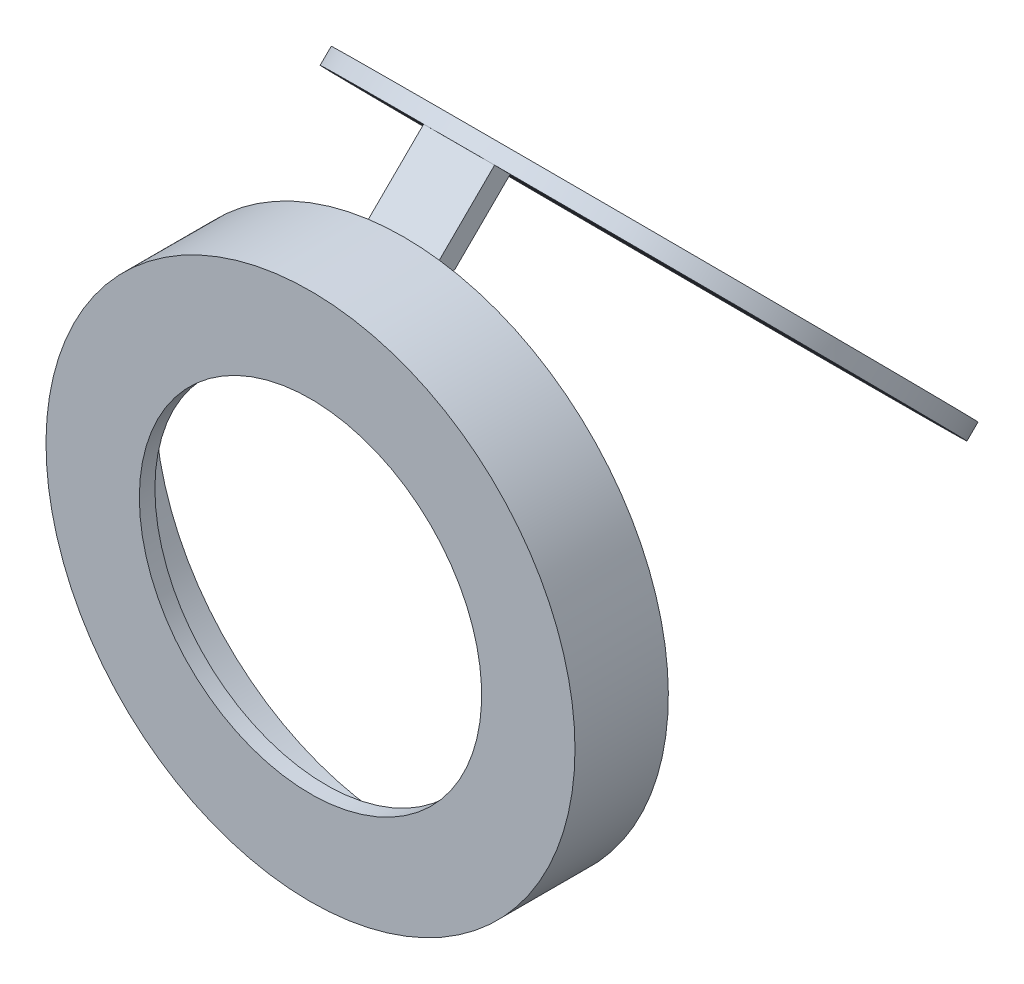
ISO-10303-21;
HEADER;
FILE_DESCRIPTION(('STEP AP214'),'2;1');
FILE_NAME('part.step','',(''),(''),'','','');
FILE_SCHEMA(('AUTOMOTIVE_DESIGN { 1 0 10303 214 1 1 1 1 }'));
ENDSEC;
DATA;
#1=APPLICATION_CONTEXT('core data for automotive mechanical design processes');
#2=APPLICATION_PROTOCOL_DEFINITION('international standard','automotive_design',2000,#1);
#3=PRODUCT_CONTEXT('',#1,'mechanical');
#4=PRODUCT('Part','Part','',(#3));
#5=PRODUCT_RELATED_PRODUCT_CATEGORY('part','',(#4));
#6=PRODUCT_DEFINITION_FORMATION('','',#4);
#7=PRODUCT_DEFINITION_CONTEXT('part definition',#1,'design');
#8=PRODUCT_DEFINITION('design','',#6,#7);
#9=PRODUCT_DEFINITION_SHAPE('','',#8);
#10=(LENGTH_UNIT() NAMED_UNIT(*) SI_UNIT(.MILLI.,.METRE.));
#11=(NAMED_UNIT(*) PLANE_ANGLE_UNIT() SI_UNIT($,.RADIAN.));
#12=(NAMED_UNIT(*) SI_UNIT($,.STERADIAN.) SOLID_ANGLE_UNIT());
#13=UNCERTAINTY_MEASURE_WITH_UNIT(LENGTH_MEASURE(1.E-05),#10,'distance_accuracy_value','');
#14=(GEOMETRIC_REPRESENTATION_CONTEXT(3) GLOBAL_UNCERTAINTY_ASSIGNED_CONTEXT((#13)) GLOBAL_UNIT_ASSIGNED_CONTEXT((#10,
#11,#12)) REPRESENTATION_CONTEXT('',''));
#15=CARTESIAN_POINT('',(0.,0.,0.));
#16=DIRECTION('',(0.,0.,1.));
#17=DIRECTION('',(1.,0.,0.));
#18=AXIS2_PLACEMENT_3D('',#15,#16,#17);
#19=CARTESIAN_POINT('',(0.,0.,-5.));
#20=DIRECTION('',(0.,0.,-1.));
#21=DIRECTION('',(-1.,0.,0.));
#22=AXIS2_PLACEMENT_3D('',#19,#20,#21);
#23=PLANE('',#22);
#24=DIRECTION('',(0.,1.,0.));
#25=VECTOR('',#24,1.);
#26=CARTESIAN_POINT('',(-2.27991716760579,16.8464232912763,-5.));
#27=LINE('',#26,#25);
#28=CARTESIAN_POINT('',(-2.27991716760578,15.8367287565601,-5.));
#29=VERTEX_POINT('',#28);
#30=CARTESIAN_POINT('',(-2.2799171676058,16.8464232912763,-5.));
#31=VERTEX_POINT('',#30);
#32=EDGE_CURVE('E55',#29,#31,#27,.T.);
#33=ORIENTED_EDGE('',*,*,#32,.F.);
#34=CARTESIAN_POINT('',(0.,0.,-5.));
#35=DIRECTION('',(0.,0.,-1.));
#36=DIRECTION('',(-1.,0.,0.));
#37=AXIS2_PLACEMENT_3D('',#34,#35,#36);
#38=CIRCLE('',#37,16.);
#39=CARTESIAN_POINT('',(2.27991716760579,15.8367287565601,-5.));
#40=VERTEX_POINT('',#39);
#41=EDGE_CURVE('E50',#40,#29,#38,.T.);
#42=ORIENTED_EDGE('',*,*,#41,.F.);
#43=DIRECTION('',(0.,-1.,0.));
#44=VECTOR('',#43,1.);
#45=CARTESIAN_POINT('',(2.27991716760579,16.8464232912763,-5.));
#46=LINE('',#45,#44);
#47=CARTESIAN_POINT('',(2.27991716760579,16.8464232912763,-5.));
#48=VERTEX_POINT('',#47);
#49=EDGE_CURVE('E130',#48,#40,#46,.T.);
#50=ORIENTED_EDGE('',*,*,#49,.F.);
#51=CARTESIAN_POINT('',(0.,0.,-5.));
#52=DIRECTION('',(0.,0.,-1.));
#53=DIRECTION('',(-1.,0.,0.));
#54=AXIS2_PLACEMENT_3D('',#51,#52,#53);
#55=CIRCLE('',#54,17.);
#56=EDGE_CURVE('E140',#48,#31,#55,.T.);
#57=ORIENTED_EDGE('',*,*,#56,.T.);
#58=EDGE_LOOP('',(#33,#42,#50,#57));
#59=FACE_BOUND('',#58,.T.);
#60=ADVANCED_FACE('F35',(#59),#23,.T.);
#61=CARTESIAN_POINT('',(0.,0.,0.));
#62=DIRECTION('',(0.,0.,1.));
#63=DIRECTION('',(1.,0.,0.));
#64=AXIS2_PLACEMENT_3D('',#61,#62,#63);
#65=PLANE('',#64);
#66=CARTESIAN_POINT('',(0.,0.,0.));
#67=DIRECTION('',(0.,0.,-1.));
#68=DIRECTION('',(-1.,0.,0.));
#69=AXIS2_PLACEMENT_3D('',#66,#67,#68);
#70=CIRCLE('',#69,16.);
#71=CARTESIAN_POINT('',(-16.,0.,0.));
#72=VERTEX_POINT('',#71);
#73=EDGE_CURVE('E137',#72,#72,#70,.T.);
#74=ORIENTED_EDGE('',*,*,#73,.T.);
#75=EDGE_LOOP('',(#74));
#76=FACE_BOUND('',#75,.T.);
#77=CARTESIAN_POINT('',(0.,0.,0.));
#78=DIRECTION('',(0.,0.,-1.));
#79=DIRECTION('',(-1.,0.,0.));
#80=AXIS2_PLACEMENT_3D('',#77,#78,#79);
#81=CIRCLE('',#80,11.);
#82=CARTESIAN_POINT('',(-11.,0.,0.));
#83=VERTEX_POINT('',#82);
#84=EDGE_CURVE('E39',#83,#83,#81,.F.);
#85=ORIENTED_EDGE('',*,*,#84,.T.);
#86=EDGE_LOOP('',(#85));
#87=FACE_BOUND('',#86,.T.);
#88=ADVANCED_FACE('F37',(#76,#87),#65,.F.);
#89=CARTESIAN_POINT('',(0.,0.,1.));
#90=DIRECTION('',(0.,0.,-1.));
#91=DIRECTION('',(-1.,0.,0.));
#92=AXIS2_PLACEMENT_3D('',#89,#90,#91);
#93=CYLINDRICAL_SURFACE('',#92,11.);
#94=ORIENTED_EDGE('',*,*,#84,.F.);
#95=EDGE_LOOP('',(#94));
#96=FACE_BOUND('',#95,.T.);
#97=CARTESIAN_POINT('',(0.,0.,1.));
#98=DIRECTION('',(0.,0.,-1.));
#99=DIRECTION('',(-1.,0.,0.));
#100=AXIS2_PLACEMENT_3D('',#97,#98,#99);
#101=CIRCLE('',#100,11.);
#102=CARTESIAN_POINT('',(-11.,0.,1.));
#103=VERTEX_POINT('',#102);
#104=EDGE_CURVE('E11',#103,#103,#101,.T.);
#105=ORIENTED_EDGE('',*,*,#104,.F.);
#106=EDGE_LOOP('',(#105));
#107=FACE_BOUND('',#106,.T.);
#108=ADVANCED_FACE('F153',(#96,#107),#93,.F.);
#109=CARTESIAN_POINT('',(0.,0.,1.));
#110=DIRECTION('',(0.,0.,1.));
#111=DIRECTION('',(1.,0.,0.));
#112=AXIS2_PLACEMENT_3D('',#109,#110,#111);
#113=PLANE('',#112);
#114=ORIENTED_EDGE('',*,*,#104,.T.);
#115=EDGE_LOOP('',(#114));
#116=FACE_BOUND('',#115,.T.);
#117=CARTESIAN_POINT('',(0.,0.,1.));
#118=DIRECTION('',(0.,0.,1.));
#119=DIRECTION('',(1.,0.,0.));
#120=AXIS2_PLACEMENT_3D('',#117,#118,#119);
#121=CIRCLE('',#120,17.);
#122=CARTESIAN_POINT('',(17.,0.,1.));
#123=VERTEX_POINT('',#122);
#124=EDGE_CURVE('E145',#123,#123,#121,.F.);
#125=ORIENTED_EDGE('',*,*,#124,.F.);
#126=EDGE_LOOP('',(#125));
#127=FACE_BOUND('',#126,.T.);
#128=ADVANCED_FACE('F156',(#116,#127),#113,.T.);
#129=CARTESIAN_POINT('',(0.,0.,49.0832611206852));
#130=DIRECTION('',(0.,0.,-1.));
#131=DIRECTION('',(-1.,0.,0.));
#132=AXIS2_PLACEMENT_3D('',#129,#130,#131);
#133=CYLINDRICAL_SURFACE('',#132,17.);
#134=ORIENTED_EDGE('',*,*,#124,.T.);
#135=EDGE_LOOP('',(#134));
#136=FACE_BOUND('',#135,.T.);
#137=EDGE_CURVE('E143',#31,#48,#55,.T.);
#138=ORIENTED_EDGE('',*,*,#137,.F.);
#139=ORIENTED_EDGE('',*,*,#56,.F.);
#140=EDGE_LOOP('',(#138,#139));
#141=FACE_BOUND('',#140,.T.);
#142=ADVANCED_FACE('F161',(#136,#141),#133,.T.);
#143=DIRECTION('',(1.,0.,0.));
#144=VECTOR('',#143,1.);
#145=CARTESIAN_POINT('',(2.27991716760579,16.8464232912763,-5.));
#146=LINE('',#145,#144);
#147=EDGE_CURVE('E127',#31,#48,#146,.T.);
#148=ORIENTED_EDGE('',*,*,#147,.F.);
#149=ORIENTED_EDGE('',*,*,#137,.T.);
#150=EDGE_LOOP('',(#148,#149));
#151=FACE_BOUND('',#150,.T.);
#152=ADVANCED_FACE('F166',(#151),#23,.T.);
#153=CARTESIAN_POINT('',(0.,0.,-5.));
#154=DIRECTION('',(0.,0.,1.));
#155=DIRECTION('',(1.,0.,0.));
#156=AXIS2_PLACEMENT_3D('',#153,#154,#155);
#157=CYLINDRICAL_SURFACE('',#156,16.);
#158=EDGE_CURVE('E138',#29,#40,#38,.T.);
#159=ORIENTED_EDGE('',*,*,#158,.T.);
#160=ORIENTED_EDGE('',*,*,#41,.T.);
#161=EDGE_LOOP('',(#159,#160));
#162=FACE_BOUND('',#161,.T.);
#163=ORIENTED_EDGE('',*,*,#73,.F.);
#164=EDGE_LOOP('',(#163));
#165=FACE_BOUND('',#164,.T.);
#166=ADVANCED_FACE('F176',(#162,#165),#157,.F.);
#167=CARTESIAN_POINT('',(-2.27991716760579,16.8464232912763,-6.));
#168=DIRECTION('',(1.,0.,0.));
#169=DIRECTION('',(0.,1.,0.));
#170=AXIS2_PLACEMENT_3D('',#167,#168,#169);
#171=PLANE('',#170);
#172=ORIENTED_EDGE('',*,*,#32,.T.);
#173=DIRECTION('',(0.,-0.703687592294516,0.710509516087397));
#174=VECTOR('',#173,1.);
#175=CARTESIAN_POINT('',(-2.2799171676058,20.3648612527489,-8.55254758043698));
#176=LINE('',#175,#174);
#177=CARTESIAN_POINT('',(-2.2799171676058,20.3648612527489,-8.55254758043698));
#178=VERTEX_POINT('',#177);
#179=EDGE_CURVE('E118',#178,#31,#176,.T.);
#180=ORIENTED_EDGE('',*,*,#179,.F.);
#181=DIRECTION('',(0.,0.710509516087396,0.703687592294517));
#182=VECTOR('',#181,1.);
#183=CARTESIAN_POINT('',(-2.27991716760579,19.3551667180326,-9.55254758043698));
#184=LINE('',#183,#182);
#185=CARTESIAN_POINT('',(-2.27991716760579,19.3551667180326,-9.55254758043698));
#186=VERTEX_POINT('',#185);
#187=EDGE_CURVE('E93',#186,#178,#184,.T.);
#188=ORIENTED_EDGE('',*,*,#187,.F.);
#189=DIRECTION('',(0.,-0.703687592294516,0.710509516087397));
#190=VECTOR('',#189,1.);
#191=CARTESIAN_POINT('',(-2.27991716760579,19.3551667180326,-9.55254758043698));
#192=LINE('',#191,#190);
#193=CARTESIAN_POINT('',(-2.27991716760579,15.8367287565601,-6.));
#194=VERTEX_POINT('',#193);
#195=EDGE_CURVE('E89',#186,#194,#192,.T.);
#196=ORIENTED_EDGE('',*,*,#195,.T.);
#197=DIRECTION('',(0.,0.,1.));
#198=VECTOR('',#197,1.);
#199=CARTESIAN_POINT('',(-2.27991716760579,15.8367287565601,-6.));
#200=LINE('',#199,#198);
#201=EDGE_CURVE('E124',#194,#29,#200,.T.);
#202=ORIENTED_EDGE('',*,*,#201,.T.);
#203=EDGE_LOOP('',(#172,#180,#188,#196,#202));
#204=FACE_BOUND('',#203,.T.);
#205=ADVANCED_FACE('F181',(#204),#171,.F.);
#206=CARTESIAN_POINT('',(2.27991716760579,16.8464232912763,-6.));
#207=DIRECTION('',(-1.,0.,0.));
#208=DIRECTION('',(0.,-1.,0.));
#209=AXIS2_PLACEMENT_3D('',#206,#207,#208);
#210=PLANE('',#209);
#211=DIRECTION('',(0.,0.,1.));
#212=VECTOR('',#211,1.);
#213=CARTESIAN_POINT('',(2.27991716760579,15.8367287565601,-6.));
#214=LINE('',#213,#212);
#215=CARTESIAN_POINT('',(2.27991716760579,15.8367287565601,-6.));
#216=VERTEX_POINT('',#215);
#217=EDGE_CURVE('E105',#216,#40,#214,.T.);
#218=ORIENTED_EDGE('',*,*,#217,.F.);
#219=DIRECTION('',(0.,-0.703687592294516,0.710509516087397));
#220=VECTOR('',#219,1.);
#221=CARTESIAN_POINT('',(2.27991716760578,19.3551667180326,-9.55254758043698));
#222=LINE('',#221,#220);
#223=CARTESIAN_POINT('',(2.27991716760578,19.3551667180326,-9.55254758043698));
#224=VERTEX_POINT('',#223);
#225=EDGE_CURVE('E87',#224,#216,#222,.T.);
#226=ORIENTED_EDGE('',*,*,#225,.F.);
#227=DIRECTION('',(0.,-0.710509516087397,-0.703687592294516));
#228=VECTOR('',#227,1.);
#229=CARTESIAN_POINT('',(2.27991716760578,20.3648612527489,-8.55254758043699));
#230=LINE('',#229,#228);
#231=CARTESIAN_POINT('',(2.27991716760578,20.3648612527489,-8.55254758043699));
#232=VERTEX_POINT('',#231);
#233=EDGE_CURVE('E101',#232,#224,#230,.T.);
#234=ORIENTED_EDGE('',*,*,#233,.F.);
#235=DIRECTION('',(0.,-0.703687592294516,0.710509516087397));
#236=VECTOR('',#235,1.);
#237=CARTESIAN_POINT('',(2.27991716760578,20.3648612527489,-8.55254758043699));
#238=LINE('',#237,#236);
#239=EDGE_CURVE('E106',#232,#48,#238,.T.);
#240=ORIENTED_EDGE('',*,*,#239,.T.);
#241=ORIENTED_EDGE('',*,*,#49,.T.);
#242=EDGE_LOOP('',(#218,#226,#234,#240,#241));
#243=FACE_BOUND('',#242,.T.);
#244=ADVANCED_FACE('F99',(#243),#210,.F.);
#245=CARTESIAN_POINT('',(2.27991716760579,15.8367287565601,-6.));
#246=DIRECTION('',(0.,1.,0.));
#247=DIRECTION('',(0.,0.,1.));
#248=AXIS2_PLACEMENT_3D('',#245,#246,#247);
#249=PLANE('',#248);
#250=DIRECTION('',(-1.,0.,0.));
#251=VECTOR('',#250,1.);
#252=CARTESIAN_POINT('',(2.27991716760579,15.8367287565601,-5.));
#253=LINE('',#252,#251);
#254=EDGE_CURVE('E125',#40,#29,#253,.T.);
#255=ORIENTED_EDGE('',*,*,#254,.T.);
#256=ORIENTED_EDGE('',*,*,#201,.F.);
#257=DIRECTION('',(-1.,0.,0.));
#258=VECTOR('',#257,1.);
#259=CARTESIAN_POINT('',(2.27991716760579,15.8367287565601,-6.));
#260=LINE('',#259,#258);
#261=EDGE_CURVE('E122',#216,#194,#260,.T.);
#262=ORIENTED_EDGE('',*,*,#261,.F.);
#263=ORIENTED_EDGE('',*,*,#217,.T.);
#264=EDGE_LOOP('',(#255,#256,#262,#263));
#265=FACE_BOUND('',#264,.T.);
#266=ADVANCED_FACE('F220',(#265),#249,.F.);
#267=CARTESIAN_POINT('',(-2.27991716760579,15.8367287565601,-5.));
#268=DIRECTION('',(0.,0.,-1.));
#269=DIRECTION('',(-1.,0.,0.));
#270=AXIS2_PLACEMENT_3D('',#267,#268,#269);
#271=PLANE('',#270);
#272=ORIENTED_EDGE('',*,*,#158,.F.);
#273=ORIENTED_EDGE('',*,*,#254,.F.);
#274=EDGE_LOOP('',(#272,#273));
#275=FACE_BOUND('',#274,.T.);
#276=ADVANCED_FACE('F217',(#275),#271,.F.);
#277=CARTESIAN_POINT('',(2.27991716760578,19.3551667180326,-9.55254758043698));
#278=DIRECTION('',(0.,0.710509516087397,0.703687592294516));
#279=DIRECTION('',(0.,-0.703687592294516,0.710509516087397));
#280=AXIS2_PLACEMENT_3D('',#277,#278,#279);
#281=PLANE('',#280);
#282=ORIENTED_EDGE('',*,*,#261,.T.);
#283=ORIENTED_EDGE('',*,*,#195,.F.);
#284=DIRECTION('',(-1.,0.,0.));
#285=VECTOR('',#284,1.);
#286=CARTESIAN_POINT('',(2.27991716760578,19.3551667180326,-9.55254758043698));
#287=LINE('',#286,#285);
#288=EDGE_CURVE('E83',#224,#186,#287,.T.);
#289=ORIENTED_EDGE('',*,*,#288,.F.);
#290=ORIENTED_EDGE('',*,*,#225,.T.);
#291=EDGE_LOOP('',(#282,#283,#289,#290));
#292=FACE_BOUND('',#291,.T.);
#293=ADVANCED_FACE('F86',(#292),#281,.F.);
#294=CARTESIAN_POINT('',(-2.2799171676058,20.3648612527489,-8.55254758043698));
#295=DIRECTION('',(0.,-0.710509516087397,-0.703687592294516));
#296=DIRECTION('',(0.,0.703687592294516,-0.710509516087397));
#297=AXIS2_PLACEMENT_3D('',#294,#295,#296);
#298=PLANE('',#297);
#299=ORIENTED_EDGE('',*,*,#147,.T.);
#300=ORIENTED_EDGE('',*,*,#239,.F.);
#301=DIRECTION('',(1.,0.,0.));
#302=VECTOR('',#301,1.);
#303=CARTESIAN_POINT('',(-2.2799171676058,20.3648612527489,-8.55254758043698));
#304=LINE('',#303,#302);
#305=EDGE_CURVE('E112',#178,#232,#304,.T.);
#306=ORIENTED_EDGE('',*,*,#305,.F.);
#307=ORIENTED_EDGE('',*,*,#179,.T.);
#308=EDGE_LOOP('',(#299,#300,#306,#307));
#309=FACE_BOUND('',#308,.T.);
#310=ADVANCED_FACE('F189',(#309),#298,.F.);
#311=CARTESIAN_POINT('',(0.,8.39531719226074,-20.4071666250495));
#312=DIRECTION('',(0.,0.703687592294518,-0.710509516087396));
#313=DIRECTION('',(0.,0.710509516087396,0.703687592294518));
#314=AXIS2_PLACEMENT_3D('',#311,#312,#313);
#315=PLANE('',#314);
#316=ORIENTED_EDGE('',*,*,#233,.T.);
#317=ORIENTED_EDGE('',*,*,#288,.T.);
#318=ORIENTED_EDGE('',*,*,#187,.T.);
#319=CARTESIAN_POINT('',(0.,8.39531719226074,-20.4071666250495));
#320=DIRECTION('',(0.,0.703687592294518,-0.710509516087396));
#321=DIRECTION('',(0.,0.710509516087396,0.703687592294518));
#322=AXIS2_PLACEMENT_3D('',#319,#320,#321);
#323=CIRCLE('',#322,17.);
#324=EDGE_CURVE('E111',#232,#178,#323,.T.);
#325=ORIENTED_EDGE('',*,*,#324,.F.);
#326=EDGE_LOOP('',(#316,#317,#318,#325));
#327=FACE_BOUND('',#326,.T.);
#328=ADVANCED_FACE('F109',(#327),#315,.F.);
#329=EDGE_CURVE('E193',#178,#232,#323,.T.);
#330=ORIENTED_EDGE('',*,*,#329,.F.);
#331=ORIENTED_EDGE('',*,*,#305,.T.);
#332=EDGE_LOOP('',(#330,#331));
#333=FACE_BOUND('',#332,.T.);
#334=ADVANCED_FACE('F194',(#333),#315,.F.);
#335=CARTESIAN_POINT('',(0.,9.09900478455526,-21.1176761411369));
#336=DIRECTION('',(0.,-0.703687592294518,0.710509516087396));
#337=DIRECTION('',(0.,-0.710509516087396,-0.703687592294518));
#338=AXIS2_PLACEMENT_3D('',#335,#336,#337);
#339=CYLINDRICAL_SURFACE('',#338,17.);
#340=CARTESIAN_POINT('',(0.,9.09900478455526,-21.1176761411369));
#341=DIRECTION('',(0.,0.703687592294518,-0.710509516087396));
#342=DIRECTION('',(0.,0.710509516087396,0.703687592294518));
#343=AXIS2_PLACEMENT_3D('',#340,#341,#342);
#344=CIRCLE('',#343,17.);
#345=CARTESIAN_POINT('',(0.,21.177666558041,-9.15498707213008));
#346=VERTEX_POINT('',#345);
#347=EDGE_CURVE('E94',#346,#346,#344,.T.);
#348=ORIENTED_EDGE('',*,*,#347,.F.);
#349=EDGE_LOOP('',(#348));
#350=FACE_BOUND('',#349,.T.);
#351=ORIENTED_EDGE('',*,*,#324,.T.);
#352=ORIENTED_EDGE('',*,*,#329,.T.);
#353=EDGE_LOOP('',(#351,#352));
#354=FACE_BOUND('',#353,.T.);
#355=ADVANCED_FACE('F197',(#350,#354),#339,.T.);
#356=CARTESIAN_POINT('',(0.,9.09900478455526,-21.1176761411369));
#357=DIRECTION('',(0.,0.703687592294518,-0.710509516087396));
#358=DIRECTION('',(0.,0.710509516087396,0.703687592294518));
#359=AXIS2_PLACEMENT_3D('',#356,#357,#358);
#360=PLANE('',#359);
#361=ORIENTED_EDGE('',*,*,#347,.T.);
#362=EDGE_LOOP('',(#361));
#363=FACE_BOUND('',#362,.T.);
#364=ADVANCED_FACE('F202',(#363),#360,.T.);
#365=CLOSED_SHELL('',(#60,#88,#108,#128,#142,#152,#166,#205,#244,#266,#276,#293,#310,#328,#334,
#355,#364));
#366=MANIFOLD_SOLID_BREP('B2',#365);
#367=ADVANCED_BREP_SHAPE_REPRESENTATION('',(#18,#366),#14);
#368=SHAPE_DEFINITION_REPRESENTATION(#9,#367);
ENDSEC;
END-ISO-10303-21;
